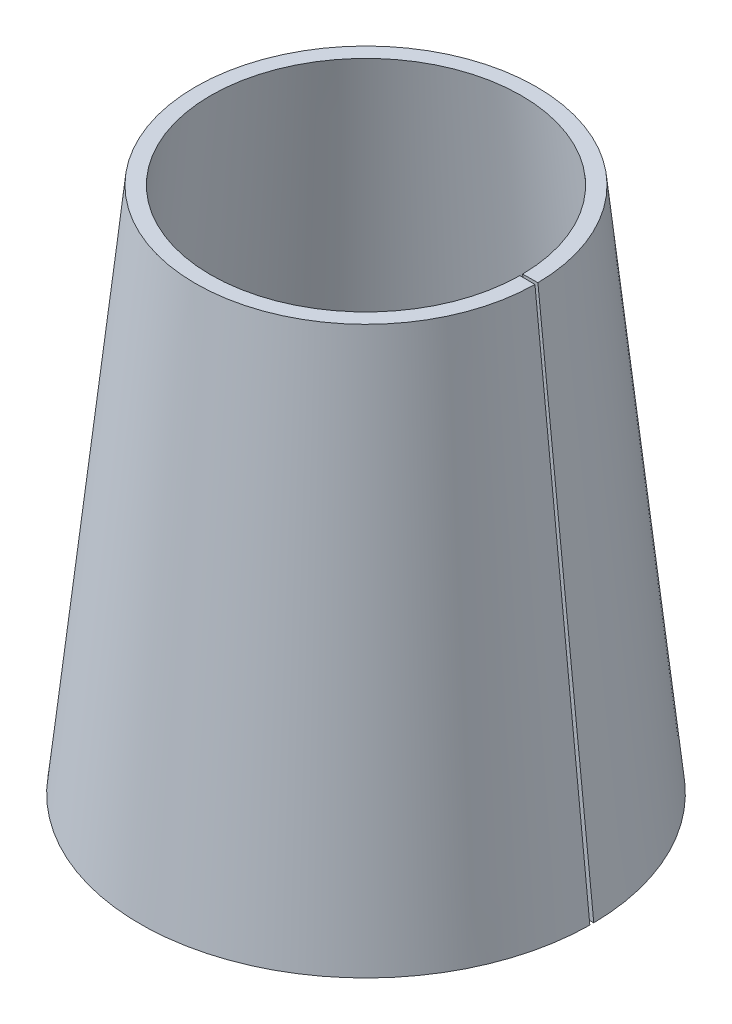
from build123d import *

# Parameters (mm, degrees)
SKETCH1_R           = 30
BOSS_EXTRUDE1_DEPTH = 70
BOSS_EXTRUDE1_TAPER = 6
SHELL1_T            = -2
CUT_EXTRUDE1_DEPTH  = 82.853527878


with BuildPart() as part:
    # Sketch1 → Boss-Extrude1 (new body)
    with BuildSketch(Plane(origin=(0, 0, 0), x_dir=(1, 0, 0), z_dir=(0, 1, 0))):
        Circle(SKETCH1_R)
    extrude(amount=BOSS_EXTRUDE1_DEPTH, taper=BOSS_EXTRUDE1_TAPER)

    # Shell1
    shell1_openings = [part.faces().sort_by_distance(p)[0] for p in [
        (0, 70, 0),
        (0, 0, 0),
    ]]
    offset(amount=SHELL1_T, openings=shell1_openings, kind=Kind.INTERSECTION)

    # Sketch2 → Cut-Extrude1 (cut, through all)
    with BuildSketch(Plane(origin=(0, 0, 0), x_dir=(1, 0, 0), z_dir=(0, 1, 0))):
        with BuildLine():
            Line((0, 0), (29.998857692, 0.261796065))
            ThreePointArc((29.998857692, 0.261796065), (30, 0), (29.998857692, -0.261796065))
            Line((29.998857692, -0.261796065), (0, 0))
        make_face()
    extrude(amount=CUT_EXTRUDE1_DEPTH, mode=Mode.SUBTRACT)


solid = part.part
